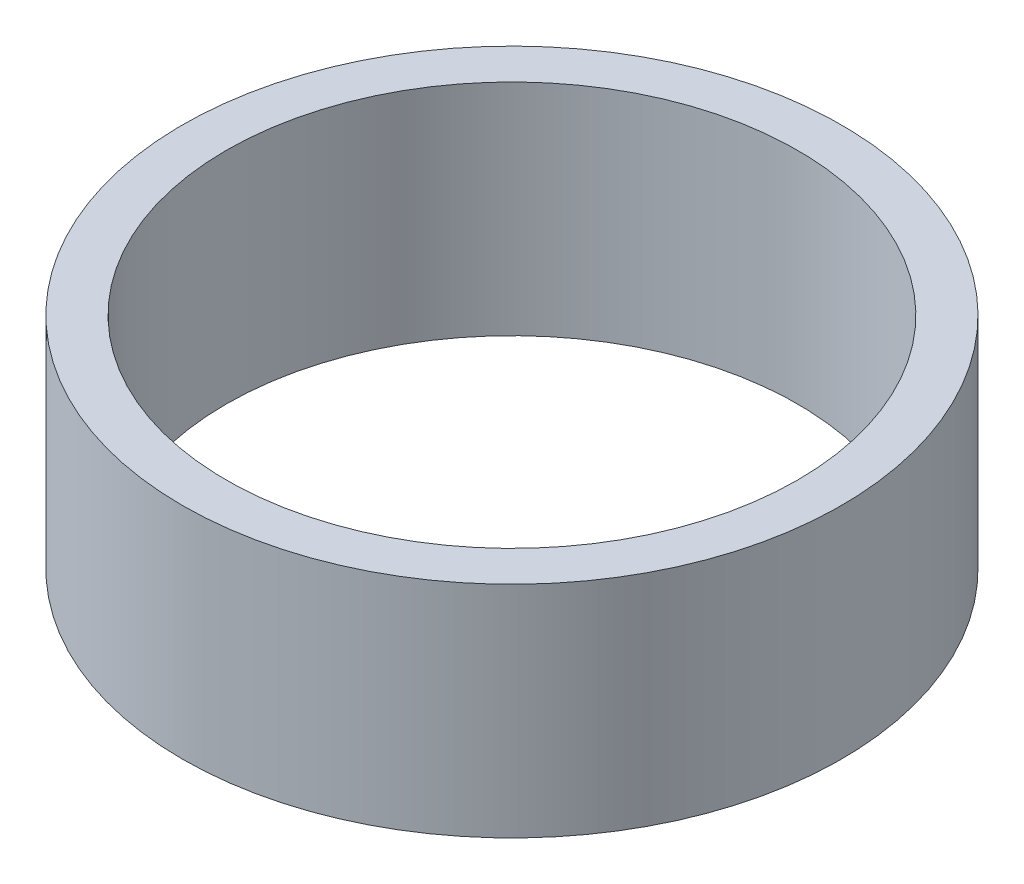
from build123d import *

# Parameters (mm, degrees)
SKETCH2_R           = 15
SKETCH2_R_2         = 13
EXTRUDE_THIN1_DEPTH = 10


with BuildPart() as part:
    # Sketch2 → Extrude-Thin1 (new body)
    with BuildSketch(Plane(origin=(0, 0, 0), x_dir=(1, 0, 0), z_dir=(0, 1, 0))):
        Circle(SKETCH2_R)
        Circle(SKETCH2_R_2, mode=Mode.SUBTRACT)
    extrude(amount=EXTRUDE_THIN1_DEPTH)


solid = part.part
